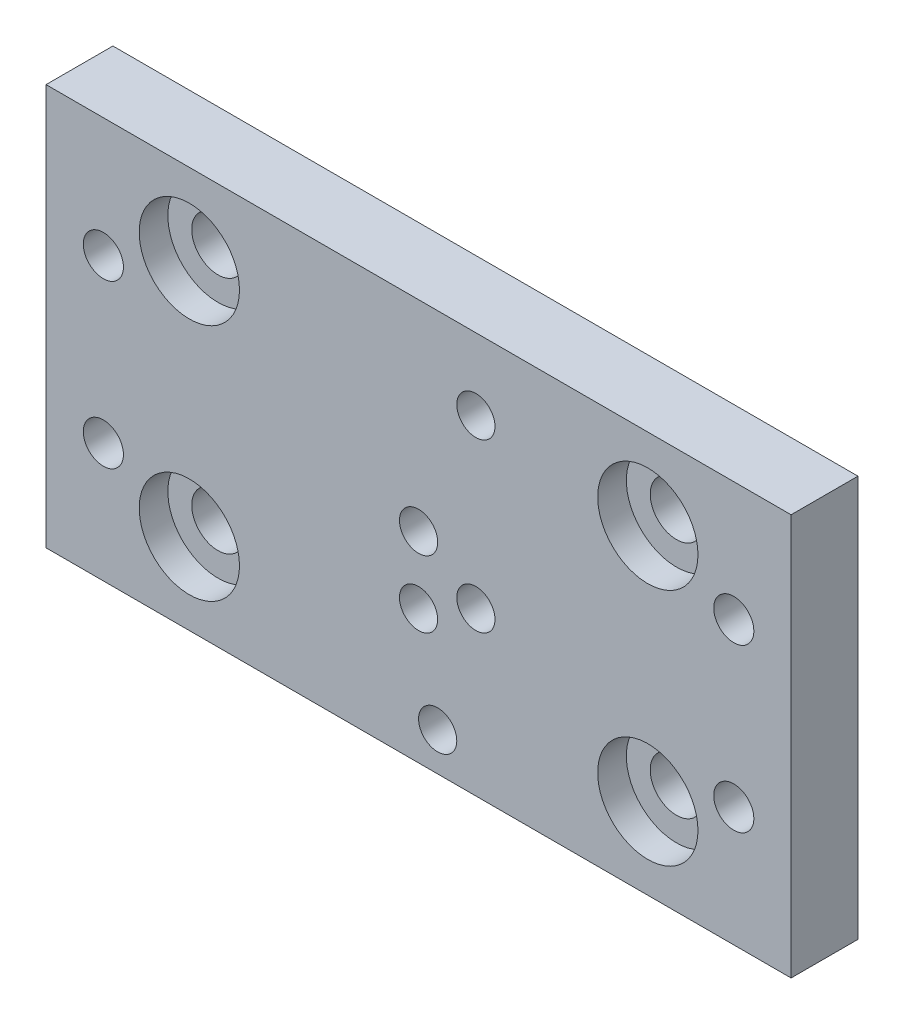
ISO-10303-21;
HEADER;
FILE_DESCRIPTION(('STEP AP214'),'2;1');
FILE_NAME('part.step','',(''),(''),'','','');
FILE_SCHEMA(('AUTOMOTIVE_DESIGN { 1 0 10303 214 1 1 1 1 }'));
ENDSEC;
DATA;
#1=APPLICATION_CONTEXT('core data for automotive mechanical design processes');
#2=APPLICATION_PROTOCOL_DEFINITION('international standard','automotive_design',2000,#1);
#3=PRODUCT_CONTEXT('',#1,'mechanical');
#4=PRODUCT('Part','Part','',(#3));
#5=PRODUCT_RELATED_PRODUCT_CATEGORY('part','',(#4));
#6=PRODUCT_DEFINITION_FORMATION('','',#4);
#7=PRODUCT_DEFINITION_CONTEXT('part definition',#1,'design');
#8=PRODUCT_DEFINITION('design','',#6,#7);
#9=PRODUCT_DEFINITION_SHAPE('','',#8);
#10=(LENGTH_UNIT() NAMED_UNIT(*) SI_UNIT(.MILLI.,.METRE.));
#11=(NAMED_UNIT(*) PLANE_ANGLE_UNIT() SI_UNIT($,.RADIAN.));
#12=(NAMED_UNIT(*) SI_UNIT($,.STERADIAN.) SOLID_ANGLE_UNIT());
#13=UNCERTAINTY_MEASURE_WITH_UNIT(LENGTH_MEASURE(1.E-05),#10,'distance_accuracy_value','');
#14=(GEOMETRIC_REPRESENTATION_CONTEXT(3) GLOBAL_UNCERTAINTY_ASSIGNED_CONTEXT((#13)) GLOBAL_UNIT_ASSIGNED_CONTEXT((#10,
#11,#12)) REPRESENTATION_CONTEXT('',''));
#15=CARTESIAN_POINT('',(0.,0.,0.));
#16=DIRECTION('',(0.,0.,1.));
#17=DIRECTION('',(1.,0.,0.));
#18=AXIS2_PLACEMENT_3D('',#15,#16,#17);
#19=CARTESIAN_POINT('',(2.,-17.,0.));
#20=DIRECTION('',(0.,0.,1.));
#21=DIRECTION('',(1.,0.,0.));
#22=AXIS2_PLACEMENT_3D('',#19,#20,#21);
#23=CYLINDRICAL_SURFACE('',#22,1.1);
#24=CARTESIAN_POINT('',(2.,-17.,0.));
#25=DIRECTION('',(0.,0.,1.));
#26=DIRECTION('',(1.,0.,0.));
#27=AXIS2_PLACEMENT_3D('',#24,#25,#26);
#28=CIRCLE('',#27,1.1);
#29=CARTESIAN_POINT('',(3.1,-17.,0.));
#30=VERTEX_POINT('',#29);
#31=EDGE_CURVE('E137',#30,#30,#28,.T.);
#32=ORIENTED_EDGE('',*,*,#31,.F.);
#33=EDGE_LOOP('',(#32));
#34=FACE_BOUND('',#33,.T.);
#35=CARTESIAN_POINT('',(2.,-17.,4.));
#36=DIRECTION('',(0.,0.,1.));
#37=DIRECTION('',(1.,0.,0.));
#38=AXIS2_PLACEMENT_3D('',#35,#36,#37);
#39=CIRCLE('',#38,1.1);
#40=CARTESIAN_POINT('',(3.1,-17.,4.));
#41=VERTEX_POINT('',#40);
#42=EDGE_CURVE('E38',#41,#41,#39,.F.);
#43=ORIENTED_EDGE('',*,*,#42,.F.);
#44=EDGE_LOOP('',(#43));
#45=FACE_BOUND('',#44,.T.);
#46=ADVANCED_FACE('F34',(#34,#45),#23,.F.);
#47=CARTESIAN_POINT('',(0.,-7.,0.));
#48=DIRECTION('',(0.,0.,1.));
#49=DIRECTION('',(1.,0.,0.));
#50=AXIS2_PLACEMENT_3D('',#47,#48,#49);
#51=CYLINDRICAL_SURFACE('',#50,1.1);
#52=CARTESIAN_POINT('',(0.,-7.,0.));
#53=DIRECTION('',(0.,0.,1.));
#54=DIRECTION('',(1.,0.,0.));
#55=AXIS2_PLACEMENT_3D('',#52,#53,#54);
#56=CIRCLE('',#55,1.1);
#57=CARTESIAN_POINT('',(1.1,-7.,0.));
#58=VERTEX_POINT('',#57);
#59=EDGE_CURVE('E180',#58,#58,#56,.T.);
#60=ORIENTED_EDGE('',*,*,#59,.F.);
#61=EDGE_LOOP('',(#60));
#62=FACE_BOUND('',#61,.T.);
#63=CARTESIAN_POINT('',(0.,-7.,4.));
#64=DIRECTION('',(0.,0.,1.));
#65=DIRECTION('',(1.,0.,0.));
#66=AXIS2_PLACEMENT_3D('',#63,#64,#65);
#67=CIRCLE('',#66,1.1);
#68=CARTESIAN_POINT('',(1.1,-7.,4.));
#69=VERTEX_POINT('',#68);
#70=EDGE_CURVE('E148',#69,#69,#67,.F.);
#71=ORIENTED_EDGE('',*,*,#70,.F.);
#72=EDGE_LOOP('',(#71));
#73=FACE_BOUND('',#72,.T.);
#74=ADVANCED_FACE('F254',(#62,#73),#51,.F.);
#75=CARTESIAN_POINT('',(6.,-4.,0.));
#76=DIRECTION('',(0.,0.,1.));
#77=DIRECTION('',(1.,0.,0.));
#78=AXIS2_PLACEMENT_3D('',#75,#76,#77);
#79=CYLINDRICAL_SURFACE('',#78,1.1);
#80=CARTESIAN_POINT('',(6.,-4.,0.));
#81=DIRECTION('',(0.,0.,1.));
#82=DIRECTION('',(1.,0.,0.));
#83=AXIS2_PLACEMENT_3D('',#80,#81,#82);
#84=CIRCLE('',#83,1.1);
#85=CARTESIAN_POINT('',(7.1,-4.,0.));
#86=VERTEX_POINT('',#85);
#87=EDGE_CURVE('E177',#86,#86,#84,.T.);
#88=ORIENTED_EDGE('',*,*,#87,.F.);
#89=EDGE_LOOP('',(#88));
#90=FACE_BOUND('',#89,.T.);
#91=CARTESIAN_POINT('',(6.,-4.,4.));
#92=DIRECTION('',(0.,0.,1.));
#93=DIRECTION('',(1.,0.,0.));
#94=AXIS2_PLACEMENT_3D('',#91,#92,#93);
#95=CIRCLE('',#94,1.1);
#96=CARTESIAN_POINT('',(7.1,-4.,4.));
#97=VERTEX_POINT('',#96);
#98=EDGE_CURVE('E144',#97,#97,#95,.F.);
#99=ORIENTED_EDGE('',*,*,#98,.F.);
#100=EDGE_LOOP('',(#99));
#101=FACE_BOUND('',#100,.T.);
#102=ADVANCED_FACE('F260',(#90,#101),#79,.F.);
#103=CARTESIAN_POINT('',(0.,0.,0.));
#104=DIRECTION('',(0.,0.,1.));
#105=DIRECTION('',(1.,0.,0.));
#106=AXIS2_PLACEMENT_3D('',#103,#104,#105);
#107=CYLINDRICAL_SURFACE('',#106,1.1);
#108=CARTESIAN_POINT('',(0.,0.,0.));
#109=DIRECTION('',(0.,0.,1.));
#110=DIRECTION('',(1.,0.,0.));
#111=AXIS2_PLACEMENT_3D('',#108,#109,#110);
#112=CIRCLE('',#111,1.1);
#113=CARTESIAN_POINT('',(1.1,0.,0.));
#114=VERTEX_POINT('',#113);
#115=EDGE_CURVE('E186',#114,#114,#112,.T.);
#116=ORIENTED_EDGE('',*,*,#115,.F.);
#117=EDGE_LOOP('',(#116));
#118=FACE_BOUND('',#117,.T.);
#119=CARTESIAN_POINT('',(0.,0.,4.));
#120=DIRECTION('',(0.,0.,1.));
#121=DIRECTION('',(1.,0.,0.));
#122=AXIS2_PLACEMENT_3D('',#119,#120,#121);
#123=CIRCLE('',#122,1.1);
#124=CARTESIAN_POINT('',(1.1,0.,4.));
#125=VERTEX_POINT('',#124);
#126=EDGE_CURVE('E139',#125,#125,#123,.F.);
#127=ORIENTED_EDGE('',*,*,#126,.F.);
#128=EDGE_LOOP('',(#127));
#129=FACE_BOUND('',#128,.T.);
#130=ADVANCED_FACE('F270',(#118,#129),#107,.F.);
#131=CARTESIAN_POINT('',(6.,13.5,0.));
#132=DIRECTION('',(0.,0.,1.));
#133=DIRECTION('',(1.,0.,0.));
#134=AXIS2_PLACEMENT_3D('',#131,#132,#133);
#135=CYLINDRICAL_SURFACE('',#134,1.1);
#136=CARTESIAN_POINT('',(6.,13.5,0.));
#137=DIRECTION('',(0.,0.,1.));
#138=DIRECTION('',(1.,0.,0.));
#139=AXIS2_PLACEMENT_3D('',#136,#137,#138);
#140=CIRCLE('',#139,1.1);
#141=CARTESIAN_POINT('',(7.1,13.5,0.));
#142=VERTEX_POINT('',#141);
#143=EDGE_CURVE('E183',#142,#142,#140,.T.);
#144=ORIENTED_EDGE('',*,*,#143,.F.);
#145=EDGE_LOOP('',(#144));
#146=FACE_BOUND('',#145,.T.);
#147=CARTESIAN_POINT('',(6.,13.5,4.));
#148=DIRECTION('',(0.,0.,1.));
#149=DIRECTION('',(1.,0.,0.));
#150=AXIS2_PLACEMENT_3D('',#147,#148,#149);
#151=CIRCLE('',#150,1.1);
#152=CARTESIAN_POINT('',(7.1,13.5,4.));
#153=VERTEX_POINT('',#152);
#154=EDGE_CURVE('E134',#153,#153,#151,.F.);
#155=ORIENTED_EDGE('',*,*,#154,.F.);
#156=EDGE_LOOP('',(#155));
#157=FACE_BOUND('',#156,.T.);
#158=ADVANCED_FACE('F273',(#146,#157),#135,.F.);
#159=CARTESIAN_POINT('',(-39.,21.,7.));
#160=DIRECTION('',(1.,0.,0.));
#161=DIRECTION('',(0.,0.,-1.));
#162=AXIS2_PLACEMENT_3D('',#159,#160,#161);
#163=PLANE('',#162);
#164=DIRECTION('',(0.,-1.,0.));
#165=VECTOR('',#164,1.);
#166=CARTESIAN_POINT('',(-39.,21.,0.));
#167=LINE('',#166,#165);
#168=CARTESIAN_POINT('',(-39.,21.,0.));
#169=VERTEX_POINT('',#168);
#170=CARTESIAN_POINT('',(-39.,-21.,0.));
#171=VERTEX_POINT('',#170);
#172=EDGE_CURVE('E81',#169,#171,#167,.T.);
#173=ORIENTED_EDGE('',*,*,#172,.T.);
#174=DIRECTION('',(0.,0.,-1.));
#175=VECTOR('',#174,1.);
#176=CARTESIAN_POINT('',(-39.,-21.,7.));
#177=LINE('',#176,#175);
#178=CARTESIAN_POINT('',(-39.,-21.,7.));
#179=VERTEX_POINT('',#178);
#180=EDGE_CURVE('E11',#179,#171,#177,.T.);
#181=ORIENTED_EDGE('',*,*,#180,.F.);
#182=DIRECTION('',(0.,-1.,0.));
#183=VECTOR('',#182,1.);
#184=CARTESIAN_POINT('',(-39.,21.,7.));
#185=LINE('',#184,#183);
#186=CARTESIAN_POINT('',(-39.,21.,7.));
#187=VERTEX_POINT('',#186);
#188=EDGE_CURVE('E104',#187,#179,#185,.T.);
#189=ORIENTED_EDGE('',*,*,#188,.F.);
#190=DIRECTION('',(0.,0.,-1.));
#191=VECTOR('',#190,1.);
#192=CARTESIAN_POINT('',(-39.,21.,7.));
#193=LINE('',#192,#191);
#194=EDGE_CURVE('E93',#187,#169,#193,.T.);
#195=ORIENTED_EDGE('',*,*,#194,.T.);
#196=EDGE_LOOP('',(#173,#181,#189,#195));
#197=FACE_BOUND('',#196,.T.);
#198=ADVANCED_FACE('F36',(#197),#163,.F.);
#199=CARTESIAN_POINT('',(-39.,-21.,7.));
#200=DIRECTION('',(0.,1.,0.));
#201=DIRECTION('',(-1.,0.,0.));
#202=AXIS2_PLACEMENT_3D('',#199,#200,#201);
#203=PLANE('',#202);
#204=DIRECTION('',(1.,0.,0.));
#205=VECTOR('',#204,1.);
#206=CARTESIAN_POINT('',(-39.,-21.,0.));
#207=LINE('',#206,#205);
#208=CARTESIAN_POINT('',(39.,-21.,0.));
#209=VERTEX_POINT('',#208);
#210=EDGE_CURVE('E77',#171,#209,#207,.T.);
#211=ORIENTED_EDGE('',*,*,#210,.T.);
#212=DIRECTION('',(0.,0.,-1.));
#213=VECTOR('',#212,1.);
#214=CARTESIAN_POINT('',(39.,-21.,7.));
#215=LINE('',#214,#213);
#216=CARTESIAN_POINT('',(39.,-21.,7.));
#217=VERTEX_POINT('',#216);
#218=EDGE_CURVE('E43',#217,#209,#215,.T.);
#219=ORIENTED_EDGE('',*,*,#218,.F.);
#220=DIRECTION('',(1.,0.,0.));
#221=VECTOR('',#220,1.);
#222=CARTESIAN_POINT('',(-39.,-21.,7.));
#223=LINE('',#222,#221);
#224=EDGE_CURVE('E89',#179,#217,#223,.T.);
#225=ORIENTED_EDGE('',*,*,#224,.F.);
#226=ORIENTED_EDGE('',*,*,#180,.T.);
#227=EDGE_LOOP('',(#211,#219,#225,#226));
#228=FACE_BOUND('',#227,.T.);
#229=ADVANCED_FACE('F88',(#228),#203,.F.);
#230=CARTESIAN_POINT('',(39.,21.,7.));
#231=DIRECTION('',(-1.,0.,0.));
#232=DIRECTION('',(0.,-1.,0.));
#233=AXIS2_PLACEMENT_3D('',#230,#231,#232);
#234=PLANE('',#233);
#235=DIRECTION('',(0.,1.,0.));
#236=VECTOR('',#235,1.);
#237=CARTESIAN_POINT('',(39.,21.,0.));
#238=LINE('',#237,#236);
#239=CARTESIAN_POINT('',(39.,21.,0.));
#240=VERTEX_POINT('',#239);
#241=EDGE_CURVE('E82',#209,#240,#238,.T.);
#242=ORIENTED_EDGE('',*,*,#241,.T.);
#243=DIRECTION('',(0.,0.,-1.));
#244=VECTOR('',#243,1.);
#245=CARTESIAN_POINT('',(39.,21.,7.));
#246=LINE('',#245,#244);
#247=CARTESIAN_POINT('',(39.,21.,7.));
#248=VERTEX_POINT('',#247);
#249=EDGE_CURVE('E110',#248,#240,#246,.T.);
#250=ORIENTED_EDGE('',*,*,#249,.F.);
#251=DIRECTION('',(0.,1.,0.));
#252=VECTOR('',#251,1.);
#253=CARTESIAN_POINT('',(39.,21.,7.));
#254=LINE('',#253,#252);
#255=EDGE_CURVE('E56',#217,#248,#254,.T.);
#256=ORIENTED_EDGE('',*,*,#255,.F.);
#257=ORIENTED_EDGE('',*,*,#218,.T.);
#258=EDGE_LOOP('',(#242,#250,#256,#257));
#259=FACE_BOUND('',#258,.T.);
#260=ADVANCED_FACE('F245',(#259),#234,.F.);
#261=CARTESIAN_POINT('',(-39.,21.,7.));
#262=DIRECTION('',(0.,-1.,0.));
#263=DIRECTION('',(1.,0.,0.));
#264=AXIS2_PLACEMENT_3D('',#261,#262,#263);
#265=PLANE('',#264);
#266=DIRECTION('',(-1.,0.,0.));
#267=VECTOR('',#266,1.);
#268=CARTESIAN_POINT('',(-39.,21.,0.));
#269=LINE('',#268,#267);
#270=EDGE_CURVE('E102',#240,#169,#269,.T.);
#271=ORIENTED_EDGE('',*,*,#270,.T.);
#272=ORIENTED_EDGE('',*,*,#194,.F.);
#273=DIRECTION('',(-1.,0.,0.));
#274=VECTOR('',#273,1.);
#275=CARTESIAN_POINT('',(-39.,21.,7.));
#276=LINE('',#275,#274);
#277=EDGE_CURVE('E51',#248,#187,#276,.T.);
#278=ORIENTED_EDGE('',*,*,#277,.F.);
#279=ORIENTED_EDGE('',*,*,#249,.T.);
#280=EDGE_LOOP('',(#271,#272,#278,#279));
#281=FACE_BOUND('',#280,.T.);
#282=ADVANCED_FACE('F241',(#281),#265,.F.);
#283=CARTESIAN_POINT('',(-39.,21.,7.));
#284=DIRECTION('',(0.,0.,1.));
#285=DIRECTION('',(1.,0.,0.));
#286=AXIS2_PLACEMENT_3D('',#283,#284,#285);
#287=PLANE('',#286);
#288=CARTESIAN_POINT('',(2.,-17.,7.));
#289=DIRECTION('',(0.,0.,1.));
#290=DIRECTION('',(1.,0.,0.));
#291=AXIS2_PLACEMENT_3D('',#288,#289,#290);
#292=CIRCLE('',#291,2.);
#293=CARTESIAN_POINT('',(4.,-17.,7.));
#294=VERTEX_POINT('',#293);
#295=EDGE_CURVE('E509',#294,#294,#292,.T.);
#296=ORIENTED_EDGE('',*,*,#295,.F.);
#297=EDGE_LOOP('',(#296));
#298=FACE_BOUND('',#297,.T.);
#299=CARTESIAN_POINT('',(0.,-7.,7.));
#300=DIRECTION('',(0.,0.,1.));
#301=DIRECTION('',(1.,0.,0.));
#302=AXIS2_PLACEMENT_3D('',#299,#300,#301);
#303=CIRCLE('',#302,2.);
#304=CARTESIAN_POINT('',(2.,-7.,7.));
#305=VERTEX_POINT('',#304);
#306=EDGE_CURVE('E157',#305,#305,#303,.T.);
#307=ORIENTED_EDGE('',*,*,#306,.F.);
#308=EDGE_LOOP('',(#307));
#309=FACE_BOUND('',#308,.T.);
#310=CARTESIAN_POINT('',(6.,-4.,7.));
#311=DIRECTION('',(0.,0.,1.));
#312=DIRECTION('',(1.,0.,0.));
#313=AXIS2_PLACEMENT_3D('',#310,#311,#312);
#314=CIRCLE('',#313,2.);
#315=CARTESIAN_POINT('',(8.,-4.,7.));
#316=VERTEX_POINT('',#315);
#317=EDGE_CURVE('E150',#316,#316,#314,.T.);
#318=ORIENTED_EDGE('',*,*,#317,.F.);
#319=EDGE_LOOP('',(#318));
#320=FACE_BOUND('',#319,.T.);
#321=CARTESIAN_POINT('',(0.,0.,7.));
#322=DIRECTION('',(0.,0.,1.));
#323=DIRECTION('',(1.,0.,0.));
#324=AXIS2_PLACEMENT_3D('',#321,#322,#323);
#325=CIRCLE('',#324,2.);
#326=CARTESIAN_POINT('',(2.,0.,7.));
#327=VERTEX_POINT('',#326);
#328=EDGE_CURVE('E146',#327,#327,#325,.T.);
#329=ORIENTED_EDGE('',*,*,#328,.F.);
#330=EDGE_LOOP('',(#329));
#331=FACE_BOUND('',#330,.T.);
#332=CARTESIAN_POINT('',(6.,13.5,7.));
#333=DIRECTION('',(0.,0.,1.));
#334=DIRECTION('',(1.,0.,0.));
#335=AXIS2_PLACEMENT_3D('',#332,#333,#334);
#336=CIRCLE('',#335,2.);
#337=CARTESIAN_POINT('',(8.,13.5,7.));
#338=VERTEX_POINT('',#337);
#339=EDGE_CURVE('E142',#338,#338,#336,.T.);
#340=ORIENTED_EDGE('',*,*,#339,.F.);
#341=EDGE_LOOP('',(#340));
#342=FACE_BOUND('',#341,.T.);
#343=CARTESIAN_POINT('',(-24.,12.5,7.));
#344=DIRECTION('',(0.,0.,1.));
#345=DIRECTION('',(1.,0.,0.));
#346=AXIS2_PLACEMENT_3D('',#343,#344,#345);
#347=CIRCLE('',#346,5.25);
#348=CARTESIAN_POINT('',(-18.75,12.5,7.));
#349=VERTEX_POINT('',#348);
#350=EDGE_CURVE('E133',#349,#349,#347,.T.);
#351=ORIENTED_EDGE('',*,*,#350,.F.);
#352=EDGE_LOOP('',(#351));
#353=FACE_BOUND('',#352,.T.);
#354=CARTESIAN_POINT('',(24.,12.5,7.));
#355=DIRECTION('',(0.,0.,1.));
#356=DIRECTION('',(1.,0.,0.));
#357=AXIS2_PLACEMENT_3D('',#354,#355,#356);
#358=CIRCLE('',#357,5.25);
#359=CARTESIAN_POINT('',(29.25,12.5,7.));
#360=VERTEX_POINT('',#359);
#361=EDGE_CURVE('E128',#360,#360,#358,.T.);
#362=ORIENTED_EDGE('',*,*,#361,.F.);
#363=EDGE_LOOP('',(#362));
#364=FACE_BOUND('',#363,.T.);
#365=CARTESIAN_POINT('',(24.,-12.5,7.));
#366=DIRECTION('',(0.,0.,1.));
#367=DIRECTION('',(1.,0.,0.));
#368=AXIS2_PLACEMENT_3D('',#365,#366,#367);
#369=CIRCLE('',#368,5.25);
#370=CARTESIAN_POINT('',(29.25,-12.5,7.));
#371=VERTEX_POINT('',#370);
#372=EDGE_CURVE('E123',#371,#371,#369,.T.);
#373=ORIENTED_EDGE('',*,*,#372,.F.);
#374=EDGE_LOOP('',(#373));
#375=FACE_BOUND('',#374,.T.);
#376=CARTESIAN_POINT('',(-24.,-12.5,7.));
#377=DIRECTION('',(0.,0.,1.));
#378=DIRECTION('',(1.,0.,0.));
#379=AXIS2_PLACEMENT_3D('',#376,#377,#378);
#380=CIRCLE('',#379,5.25);
#381=CARTESIAN_POINT('',(-18.75,-12.5,7.));
#382=VERTEX_POINT('',#381);
#383=EDGE_CURVE('E118',#382,#382,#380,.T.);
#384=ORIENTED_EDGE('',*,*,#383,.F.);
#385=EDGE_LOOP('',(#384));
#386=FACE_BOUND('',#385,.T.);
#387=CARTESIAN_POINT('',(33.,-8.5,7.));
#388=DIRECTION('',(0.,0.,1.));
#389=DIRECTION('',(1.,0.,0.));
#390=AXIS2_PLACEMENT_3D('',#387,#388,#389);
#391=CIRCLE('',#390,2.09999999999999);
#392=CARTESIAN_POINT('',(35.1,-8.5,7.));
#393=VERTEX_POINT('',#392);
#394=EDGE_CURVE('E117',#393,#393,#391,.T.);
#395=ORIENTED_EDGE('',*,*,#394,.F.);
#396=EDGE_LOOP('',(#395));
#397=FACE_BOUND('',#396,.T.);
#398=CARTESIAN_POINT('',(-33.,-8.5,7.));
#399=DIRECTION('',(0.,0.,1.));
#400=DIRECTION('',(1.,0.,0.));
#401=AXIS2_PLACEMENT_3D('',#398,#399,#400);
#402=CIRCLE('',#401,2.09999999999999);
#403=CARTESIAN_POINT('',(-30.9,-8.5,7.));
#404=VERTEX_POINT('',#403);
#405=EDGE_CURVE('E223',#404,#404,#402,.T.);
#406=ORIENTED_EDGE('',*,*,#405,.F.);
#407=EDGE_LOOP('',(#406));
#408=FACE_BOUND('',#407,.T.);
#409=CARTESIAN_POINT('',(-33.,8.5,7.));
#410=DIRECTION('',(0.,0.,1.));
#411=DIRECTION('',(1.,0.,0.));
#412=AXIS2_PLACEMENT_3D('',#409,#410,#411);
#413=CIRCLE('',#412,2.09999999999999);
#414=CARTESIAN_POINT('',(-30.9,8.5,7.));
#415=VERTEX_POINT('',#414);
#416=EDGE_CURVE('E229',#415,#415,#413,.T.);
#417=ORIENTED_EDGE('',*,*,#416,.F.);
#418=EDGE_LOOP('',(#417));
#419=FACE_BOUND('',#418,.T.);
#420=CARTESIAN_POINT('',(33.,8.5,7.));
#421=DIRECTION('',(0.,0.,1.));
#422=DIRECTION('',(1.,0.,0.));
#423=AXIS2_PLACEMENT_3D('',#420,#421,#422);
#424=CIRCLE('',#423,2.09999999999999);
#425=CARTESIAN_POINT('',(35.1,8.5,7.));
#426=VERTEX_POINT('',#425);
#427=EDGE_CURVE('E97',#426,#426,#424,.T.);
#428=ORIENTED_EDGE('',*,*,#427,.F.);
#429=EDGE_LOOP('',(#428));
#430=FACE_BOUND('',#429,.T.);
#431=ORIENTED_EDGE('',*,*,#188,.T.);
#432=ORIENTED_EDGE('',*,*,#224,.T.);
#433=ORIENTED_EDGE('',*,*,#255,.T.);
#434=ORIENTED_EDGE('',*,*,#277,.T.);
#435=EDGE_LOOP('',(#431,#432,#433,#434));
#436=FACE_BOUND('',#435,.T.);
#437=ADVANCED_FACE('F239',(#298,#309,#320,#331,#342,#353,#364,#375,#386,#397,#408,#419,#430,
#436),#287,.T.);
#438=CARTESIAN_POINT('',(-39.,21.,0.));
#439=DIRECTION('',(0.,0.,1.));
#440=DIRECTION('',(1.,0.,0.));
#441=AXIS2_PLACEMENT_3D('',#438,#439,#440);
#442=PLANE('',#441);
#443=ORIENTED_EDGE('',*,*,#31,.T.);
#444=EDGE_LOOP('',(#443));
#445=FACE_BOUND('',#444,.T.);
#446=ORIENTED_EDGE('',*,*,#87,.T.);
#447=EDGE_LOOP('',(#446));
#448=FACE_BOUND('',#447,.T.);
#449=ORIENTED_EDGE('',*,*,#59,.T.);
#450=EDGE_LOOP('',(#449));
#451=FACE_BOUND('',#450,.T.);
#452=ORIENTED_EDGE('',*,*,#143,.T.);
#453=EDGE_LOOP('',(#452));
#454=FACE_BOUND('',#453,.T.);
#455=ORIENTED_EDGE('',*,*,#115,.T.);
#456=EDGE_LOOP('',(#455));
#457=FACE_BOUND('',#456,.T.);
#458=CARTESIAN_POINT('',(-24.,12.5,0.));
#459=DIRECTION('',(0.,0.,1.));
#460=DIRECTION('',(1.,0.,0.));
#461=AXIS2_PLACEMENT_3D('',#458,#459,#460);
#462=CIRCLE('',#461,2.75);
#463=CARTESIAN_POINT('',(-21.25,12.5,0.));
#464=VERTEX_POINT('',#463);
#465=EDGE_CURVE('E129',#464,#464,#462,.T.);
#466=ORIENTED_EDGE('',*,*,#465,.T.);
#467=EDGE_LOOP('',(#466));
#468=FACE_BOUND('',#467,.T.);
#469=CARTESIAN_POINT('',(24.,12.5,0.));
#470=DIRECTION('',(0.,0.,1.));
#471=DIRECTION('',(1.,0.,0.));
#472=AXIS2_PLACEMENT_3D('',#469,#470,#471);
#473=CIRCLE('',#472,2.75);
#474=CARTESIAN_POINT('',(26.75,12.5,0.));
#475=VERTEX_POINT('',#474);
#476=EDGE_CURVE('E124',#475,#475,#473,.T.);
#477=ORIENTED_EDGE('',*,*,#476,.T.);
#478=EDGE_LOOP('',(#477));
#479=FACE_BOUND('',#478,.T.);
#480=CARTESIAN_POINT('',(24.,-12.5,0.));
#481=DIRECTION('',(0.,0.,1.));
#482=DIRECTION('',(1.,0.,0.));
#483=AXIS2_PLACEMENT_3D('',#480,#481,#482);
#484=CIRCLE('',#483,2.75);
#485=CARTESIAN_POINT('',(26.75,-12.5,0.));
#486=VERTEX_POINT('',#485);
#487=EDGE_CURVE('E119',#486,#486,#484,.T.);
#488=ORIENTED_EDGE('',*,*,#487,.T.);
#489=EDGE_LOOP('',(#488));
#490=FACE_BOUND('',#489,.T.);
#491=CARTESIAN_POINT('',(-24.,-12.5,0.));
#492=DIRECTION('',(0.,0.,1.));
#493=DIRECTION('',(1.,0.,0.));
#494=AXIS2_PLACEMENT_3D('',#491,#492,#493);
#495=CIRCLE('',#494,2.75);
#496=CARTESIAN_POINT('',(-21.25,-12.5,0.));
#497=VERTEX_POINT('',#496);
#498=EDGE_CURVE('E114',#497,#497,#495,.T.);
#499=ORIENTED_EDGE('',*,*,#498,.T.);
#500=EDGE_LOOP('',(#499));
#501=FACE_BOUND('',#500,.T.);
#502=CARTESIAN_POINT('',(33.,-8.5,0.));
#503=DIRECTION('',(0.,0.,1.));
#504=DIRECTION('',(1.,0.,0.));
#505=AXIS2_PLACEMENT_3D('',#502,#503,#504);
#506=CIRCLE('',#505,2.1);
#507=CARTESIAN_POINT('',(35.1,-8.5,0.));
#508=VERTEX_POINT('',#507);
#509=EDGE_CURVE('E220',#508,#508,#506,.T.);
#510=ORIENTED_EDGE('',*,*,#509,.T.);
#511=EDGE_LOOP('',(#510));
#512=FACE_BOUND('',#511,.T.);
#513=CARTESIAN_POINT('',(-33.,-8.5,0.));
#514=DIRECTION('',(0.,0.,1.));
#515=DIRECTION('',(1.,0.,0.));
#516=AXIS2_PLACEMENT_3D('',#513,#514,#515);
#517=CIRCLE('',#516,2.1);
#518=CARTESIAN_POINT('',(-30.9,-8.5,0.));
#519=VERTEX_POINT('',#518);
#520=EDGE_CURVE('E226',#519,#519,#517,.T.);
#521=ORIENTED_EDGE('',*,*,#520,.T.);
#522=EDGE_LOOP('',(#521));
#523=FACE_BOUND('',#522,.T.);
#524=CARTESIAN_POINT('',(-33.,8.5,0.));
#525=DIRECTION('',(0.,0.,1.));
#526=DIRECTION('',(1.,0.,0.));
#527=AXIS2_PLACEMENT_3D('',#524,#525,#526);
#528=CIRCLE('',#527,2.1);
#529=CARTESIAN_POINT('',(-30.9,8.5,0.));
#530=VERTEX_POINT('',#529);
#531=EDGE_CURVE('E232',#530,#530,#528,.T.);
#532=ORIENTED_EDGE('',*,*,#531,.T.);
#533=EDGE_LOOP('',(#532));
#534=FACE_BOUND('',#533,.T.);
#535=CARTESIAN_POINT('',(33.,8.5,0.));
#536=DIRECTION('',(0.,0.,1.));
#537=DIRECTION('',(1.,0.,0.));
#538=AXIS2_PLACEMENT_3D('',#535,#536,#537);
#539=CIRCLE('',#538,2.1);
#540=CARTESIAN_POINT('',(35.1,8.5,0.));
#541=VERTEX_POINT('',#540);
#542=EDGE_CURVE('E94',#541,#541,#539,.T.);
#543=ORIENTED_EDGE('',*,*,#542,.T.);
#544=EDGE_LOOP('',(#543));
#545=FACE_BOUND('',#544,.T.);
#546=ORIENTED_EDGE('',*,*,#172,.F.);
#547=ORIENTED_EDGE('',*,*,#270,.F.);
#548=ORIENTED_EDGE('',*,*,#241,.F.);
#549=ORIENTED_EDGE('',*,*,#210,.F.);
#550=EDGE_LOOP('',(#546,#547,#548,#549));
#551=FACE_BOUND('',#550,.T.);
#552=ADVANCED_FACE('F78',(#445,#448,#451,#454,#457,#468,#479,#490,#501,#512,#523,#534,#545,
#551),#442,.F.);
#553=CARTESIAN_POINT('',(33.,8.5,7.));
#554=DIRECTION('',(0.,0.,1.));
#555=DIRECTION('',(1.,0.,0.));
#556=AXIS2_PLACEMENT_3D('',#553,#554,#555);
#557=CYLINDRICAL_SURFACE('',#556,2.09999999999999);
#558=ORIENTED_EDGE('',*,*,#542,.F.);
#559=EDGE_LOOP('',(#558));
#560=FACE_BOUND('',#559,.T.);
#561=ORIENTED_EDGE('',*,*,#427,.T.);
#562=EDGE_LOOP('',(#561));
#563=FACE_BOUND('',#562,.T.);
#564=ADVANCED_FACE('F237',(#560,#563),#557,.F.);
#565=CARTESIAN_POINT('',(-33.,8.5,7.));
#566=DIRECTION('',(0.,0.,1.));
#567=DIRECTION('',(1.,0.,0.));
#568=AXIS2_PLACEMENT_3D('',#565,#566,#567);
#569=CYLINDRICAL_SURFACE('',#568,2.09999999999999);
#570=ORIENTED_EDGE('',*,*,#531,.F.);
#571=EDGE_LOOP('',(#570));
#572=FACE_BOUND('',#571,.T.);
#573=ORIENTED_EDGE('',*,*,#416,.T.);
#574=EDGE_LOOP('',(#573));
#575=FACE_BOUND('',#574,.T.);
#576=ADVANCED_FACE('F336',(#572,#575),#569,.F.);
#577=CARTESIAN_POINT('',(-33.,-8.5,7.));
#578=DIRECTION('',(0.,0.,1.));
#579=DIRECTION('',(1.,0.,0.));
#580=AXIS2_PLACEMENT_3D('',#577,#578,#579);
#581=CYLINDRICAL_SURFACE('',#580,2.09999999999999);
#582=ORIENTED_EDGE('',*,*,#520,.F.);
#583=EDGE_LOOP('',(#582));
#584=FACE_BOUND('',#583,.T.);
#585=ORIENTED_EDGE('',*,*,#405,.T.);
#586=EDGE_LOOP('',(#585));
#587=FACE_BOUND('',#586,.T.);
#588=ADVANCED_FACE('F332',(#584,#587),#581,.F.);
#589=CARTESIAN_POINT('',(33.,-8.5,7.));
#590=DIRECTION('',(0.,0.,1.));
#591=DIRECTION('',(1.,0.,0.));
#592=AXIS2_PLACEMENT_3D('',#589,#590,#591);
#593=CYLINDRICAL_SURFACE('',#592,2.09999999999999);
#594=ORIENTED_EDGE('',*,*,#509,.F.);
#595=EDGE_LOOP('',(#594));
#596=FACE_BOUND('',#595,.T.);
#597=ORIENTED_EDGE('',*,*,#394,.T.);
#598=EDGE_LOOP('',(#597));
#599=FACE_BOUND('',#598,.T.);
#600=ADVANCED_FACE('F322',(#596,#599),#593,.F.);
#601=CARTESIAN_POINT('',(-24.,-12.5,7.));
#602=DIRECTION('',(0.,0.,1.));
#603=DIRECTION('',(1.,0.,0.));
#604=AXIS2_PLACEMENT_3D('',#601,#602,#603);
#605=CYLINDRICAL_SURFACE('',#604,2.75);
#606=CARTESIAN_POINT('',(-24.,-12.5,4.));
#607=DIRECTION('',(0.,0.,1.));
#608=DIRECTION('',(1.,0.,0.));
#609=AXIS2_PLACEMENT_3D('',#606,#607,#608);
#610=CIRCLE('',#609,2.75);
#611=CARTESIAN_POINT('',(-21.25,-12.5,4.));
#612=VERTEX_POINT('',#611);
#613=EDGE_CURVE('E122',#612,#612,#610,.T.);
#614=ORIENTED_EDGE('',*,*,#613,.T.);
#615=EDGE_LOOP('',(#614));
#616=FACE_BOUND('',#615,.T.);
#617=ORIENTED_EDGE('',*,*,#498,.F.);
#618=EDGE_LOOP('',(#617));
#619=FACE_BOUND('',#618,.T.);
#620=ADVANCED_FACE('F318',(#616,#619),#605,.F.);
#621=CARTESIAN_POINT('',(-24.,-12.5,7.));
#622=DIRECTION('',(0.,0.,1.));
#623=DIRECTION('',(1.,0.,0.));
#624=AXIS2_PLACEMENT_3D('',#621,#622,#623);
#625=CYLINDRICAL_SURFACE('',#624,5.25);
#626=CARTESIAN_POINT('',(-24.,-12.5,4.));
#627=DIRECTION('',(0.,0.,1.));
#628=DIRECTION('',(1.,0.,0.));
#629=AXIS2_PLACEMENT_3D('',#626,#627,#628);
#630=CIRCLE('',#629,5.25);
#631=CARTESIAN_POINT('',(-18.75,-12.5,4.));
#632=VERTEX_POINT('',#631);
#633=EDGE_CURVE('E213',#632,#632,#630,.T.);
#634=ORIENTED_EDGE('',*,*,#633,.F.);
#635=EDGE_LOOP('',(#634));
#636=FACE_BOUND('',#635,.T.);
#637=ORIENTED_EDGE('',*,*,#383,.T.);
#638=EDGE_LOOP('',(#637));
#639=FACE_BOUND('',#638,.T.);
#640=ADVANCED_FACE('F321',(#636,#639),#625,.F.);
#641=CARTESIAN_POINT('',(-21.25,-12.5,4.));
#642=DIRECTION('',(0.,0.,-1.));
#643=DIRECTION('',(-1.,0.,0.));
#644=AXIS2_PLACEMENT_3D('',#641,#642,#643);
#645=PLANE('',#644);
#646=ORIENTED_EDGE('',*,*,#613,.F.);
#647=EDGE_LOOP('',(#646));
#648=FACE_BOUND('',#647,.T.);
#649=ORIENTED_EDGE('',*,*,#633,.T.);
#650=EDGE_LOOP('',(#649));
#651=FACE_BOUND('',#650,.T.);
#652=ADVANCED_FACE('F310',(#648,#651),#645,.F.);
#653=CARTESIAN_POINT('',(24.,-12.5,7.));
#654=DIRECTION('',(0.,0.,1.));
#655=DIRECTION('',(1.,0.,0.));
#656=AXIS2_PLACEMENT_3D('',#653,#654,#655);
#657=CYLINDRICAL_SURFACE('',#656,2.75);
#658=CARTESIAN_POINT('',(24.,-12.5,4.));
#659=DIRECTION('',(0.,0.,1.));
#660=DIRECTION('',(1.,0.,0.));
#661=AXIS2_PLACEMENT_3D('',#658,#659,#660);
#662=CIRCLE('',#661,2.75);
#663=CARTESIAN_POINT('',(26.75,-12.5,4.));
#664=VERTEX_POINT('',#663);
#665=EDGE_CURVE('E127',#664,#664,#662,.T.);
#666=ORIENTED_EDGE('',*,*,#665,.T.);
#667=EDGE_LOOP('',(#666));
#668=FACE_BOUND('',#667,.T.);
#669=ORIENTED_EDGE('',*,*,#487,.F.);
#670=EDGE_LOOP('',(#669));
#671=FACE_BOUND('',#670,.T.);
#672=ADVANCED_FACE('F306',(#668,#671),#657,.F.);
#673=CARTESIAN_POINT('',(24.,-12.5,7.));
#674=DIRECTION('',(0.,0.,1.));
#675=DIRECTION('',(1.,0.,0.));
#676=AXIS2_PLACEMENT_3D('',#673,#674,#675);
#677=CYLINDRICAL_SURFACE('',#676,5.25);
#678=CARTESIAN_POINT('',(24.,-12.5,4.));
#679=DIRECTION('',(0.,0.,1.));
#680=DIRECTION('',(1.,0.,0.));
#681=AXIS2_PLACEMENT_3D('',#678,#679,#680);
#682=CIRCLE('',#681,5.25);
#683=CARTESIAN_POINT('',(29.25,-12.5,4.));
#684=VERTEX_POINT('',#683);
#685=EDGE_CURVE('E206',#684,#684,#682,.T.);
#686=ORIENTED_EDGE('',*,*,#685,.F.);
#687=EDGE_LOOP('',(#686));
#688=FACE_BOUND('',#687,.T.);
#689=ORIENTED_EDGE('',*,*,#372,.T.);
#690=EDGE_LOOP('',(#689));
#691=FACE_BOUND('',#690,.T.);
#692=ADVANCED_FACE('F309',(#688,#691),#677,.F.);
#693=CARTESIAN_POINT('',(26.75,-12.5,4.));
#694=DIRECTION('',(0.,0.,-1.));
#695=DIRECTION('',(-1.,0.,0.));
#696=AXIS2_PLACEMENT_3D('',#693,#694,#695);
#697=PLANE('',#696);
#698=ORIENTED_EDGE('',*,*,#665,.F.);
#699=EDGE_LOOP('',(#698));
#700=FACE_BOUND('',#699,.T.);
#701=ORIENTED_EDGE('',*,*,#685,.T.);
#702=EDGE_LOOP('',(#701));
#703=FACE_BOUND('',#702,.T.);
#704=ADVANCED_FACE('F298',(#700,#703),#697,.F.);
#705=CARTESIAN_POINT('',(24.,12.5,7.));
#706=DIRECTION('',(0.,0.,1.));
#707=DIRECTION('',(1.,0.,0.));
#708=AXIS2_PLACEMENT_3D('',#705,#706,#707);
#709=CYLINDRICAL_SURFACE('',#708,2.75);
#710=CARTESIAN_POINT('',(24.,12.5,4.));
#711=DIRECTION('',(0.,0.,1.));
#712=DIRECTION('',(1.,0.,0.));
#713=AXIS2_PLACEMENT_3D('',#710,#711,#712);
#714=CIRCLE('',#713,2.75);
#715=CARTESIAN_POINT('',(26.75,12.5,4.));
#716=VERTEX_POINT('',#715);
#717=EDGE_CURVE('E132',#716,#716,#714,.T.);
#718=ORIENTED_EDGE('',*,*,#717,.T.);
#719=EDGE_LOOP('',(#718));
#720=FACE_BOUND('',#719,.T.);
#721=ORIENTED_EDGE('',*,*,#476,.F.);
#722=EDGE_LOOP('',(#721));
#723=FACE_BOUND('',#722,.T.);
#724=ADVANCED_FACE('F294',(#720,#723),#709,.F.);
#725=CARTESIAN_POINT('',(24.,12.5,7.));
#726=DIRECTION('',(0.,0.,1.));
#727=DIRECTION('',(1.,0.,0.));
#728=AXIS2_PLACEMENT_3D('',#725,#726,#727);
#729=CYLINDRICAL_SURFACE('',#728,5.25);
#730=CARTESIAN_POINT('',(24.,12.5,4.));
#731=DIRECTION('',(0.,0.,1.));
#732=DIRECTION('',(1.,0.,0.));
#733=AXIS2_PLACEMENT_3D('',#730,#731,#732);
#734=CIRCLE('',#733,5.25);
#735=CARTESIAN_POINT('',(29.25,12.5,4.));
#736=VERTEX_POINT('',#735);
#737=EDGE_CURVE('E199',#736,#736,#734,.T.);
#738=ORIENTED_EDGE('',*,*,#737,.F.);
#739=EDGE_LOOP('',(#738));
#740=FACE_BOUND('',#739,.T.);
#741=ORIENTED_EDGE('',*,*,#361,.T.);
#742=EDGE_LOOP('',(#741));
#743=FACE_BOUND('',#742,.T.);
#744=ADVANCED_FACE('F297',(#740,#743),#729,.F.);
#745=CARTESIAN_POINT('',(26.75,12.5,4.));
#746=DIRECTION('',(0.,0.,-1.));
#747=DIRECTION('',(-1.,0.,0.));
#748=AXIS2_PLACEMENT_3D('',#745,#746,#747);
#749=PLANE('',#748);
#750=ORIENTED_EDGE('',*,*,#717,.F.);
#751=EDGE_LOOP('',(#750));
#752=FACE_BOUND('',#751,.T.);
#753=ORIENTED_EDGE('',*,*,#737,.T.);
#754=EDGE_LOOP('',(#753));
#755=FACE_BOUND('',#754,.T.);
#756=ADVANCED_FACE('F284',(#752,#755),#749,.F.);
#757=CARTESIAN_POINT('',(-24.,12.5,7.));
#758=DIRECTION('',(0.,0.,1.));
#759=DIRECTION('',(1.,0.,0.));
#760=AXIS2_PLACEMENT_3D('',#757,#758,#759);
#761=CYLINDRICAL_SURFACE('',#760,2.75);
#762=CARTESIAN_POINT('',(-24.,12.5,4.));
#763=DIRECTION('',(0.,0.,1.));
#764=DIRECTION('',(1.,0.,0.));
#765=AXIS2_PLACEMENT_3D('',#762,#763,#764);
#766=CIRCLE('',#765,2.75);
#767=CARTESIAN_POINT('',(-21.25,12.5,4.));
#768=VERTEX_POINT('',#767);
#769=EDGE_CURVE('E189',#768,#768,#766,.T.);
#770=ORIENTED_EDGE('',*,*,#769,.T.);
#771=EDGE_LOOP('',(#770));
#772=FACE_BOUND('',#771,.T.);
#773=ORIENTED_EDGE('',*,*,#465,.F.);
#774=EDGE_LOOP('',(#773));
#775=FACE_BOUND('',#774,.T.);
#776=ADVANCED_FACE('F280',(#772,#775),#761,.F.);
#777=CARTESIAN_POINT('',(-24.,12.5,7.));
#778=DIRECTION('',(0.,0.,1.));
#779=DIRECTION('',(1.,0.,0.));
#780=AXIS2_PLACEMENT_3D('',#777,#778,#779);
#781=CYLINDRICAL_SURFACE('',#780,5.25);
#782=CARTESIAN_POINT('',(-24.,12.5,4.));
#783=DIRECTION('',(0.,0.,1.));
#784=DIRECTION('',(1.,0.,0.));
#785=AXIS2_PLACEMENT_3D('',#782,#783,#784);
#786=CIRCLE('',#785,5.25);
#787=CARTESIAN_POINT('',(-18.75,12.5,4.));
#788=VERTEX_POINT('',#787);
#789=EDGE_CURVE('E192',#788,#788,#786,.T.);
#790=ORIENTED_EDGE('',*,*,#789,.F.);
#791=EDGE_LOOP('',(#790));
#792=FACE_BOUND('',#791,.T.);
#793=ORIENTED_EDGE('',*,*,#350,.T.);
#794=EDGE_LOOP('',(#793));
#795=FACE_BOUND('',#794,.T.);
#796=ADVANCED_FACE('F283',(#792,#795),#781,.F.);
#797=CARTESIAN_POINT('',(-21.25,12.5,4.));
#798=DIRECTION('',(0.,0.,-1.));
#799=DIRECTION('',(-1.,0.,0.));
#800=AXIS2_PLACEMENT_3D('',#797,#798,#799);
#801=PLANE('',#800);
#802=ORIENTED_EDGE('',*,*,#769,.F.);
#803=EDGE_LOOP('',(#802));
#804=FACE_BOUND('',#803,.T.);
#805=ORIENTED_EDGE('',*,*,#789,.T.);
#806=EDGE_LOOP('',(#805));
#807=FACE_BOUND('',#806,.T.);
#808=ADVANCED_FACE('F286',(#804,#807),#801,.F.);
#809=CARTESIAN_POINT('',(6.,13.5,4.));
#810=DIRECTION('',(0.,0.,1.));
#811=DIRECTION('',(1.,0.,0.));
#812=AXIS2_PLACEMENT_3D('',#809,#810,#811);
#813=PLANE('',#812);
#814=CARTESIAN_POINT('',(6.,13.5,4.));
#815=DIRECTION('',(0.,0.,1.));
#816=DIRECTION('',(1.,0.,0.));
#817=AXIS2_PLACEMENT_3D('',#814,#815,#816);
#818=CIRCLE('',#817,2.);
#819=CARTESIAN_POINT('',(8.,13.5,4.));
#820=VERTEX_POINT('',#819);
#821=EDGE_CURVE('E138',#820,#820,#818,.T.);
#822=ORIENTED_EDGE('',*,*,#821,.T.);
#823=EDGE_LOOP('',(#822));
#824=FACE_BOUND('',#823,.T.);
#825=ORIENTED_EDGE('',*,*,#154,.T.);
#826=EDGE_LOOP('',(#825));
#827=FACE_BOUND('',#826,.T.);
#828=ADVANCED_FACE('F289',(#824,#827),#813,.T.);
#829=CARTESIAN_POINT('',(6.,13.5,4.));
#830=DIRECTION('',(0.,0.,1.));
#831=DIRECTION('',(1.,0.,0.));
#832=AXIS2_PLACEMENT_3D('',#829,#830,#831);
#833=CYLINDRICAL_SURFACE('',#832,2.);
#834=ORIENTED_EDGE('',*,*,#821,.F.);
#835=EDGE_LOOP('',(#834));
#836=FACE_BOUND('',#835,.T.);
#837=ORIENTED_EDGE('',*,*,#339,.T.);
#838=EDGE_LOOP('',(#837));
#839=FACE_BOUND('',#838,.T.);
#840=ADVANCED_FACE('F267',(#836,#839),#833,.F.);
#841=CARTESIAN_POINT('',(0.,0.,4.));
#842=DIRECTION('',(0.,0.,1.));
#843=DIRECTION('',(1.,0.,0.));
#844=AXIS2_PLACEMENT_3D('',#841,#842,#843);
#845=PLANE('',#844);
#846=CARTESIAN_POINT('',(0.,0.,4.));
#847=DIRECTION('',(0.,0.,1.));
#848=DIRECTION('',(1.,0.,0.));
#849=AXIS2_PLACEMENT_3D('',#846,#847,#848);
#850=CIRCLE('',#849,2.);
#851=CARTESIAN_POINT('',(2.,0.,4.));
#852=VERTEX_POINT('',#851);
#853=EDGE_CURVE('E143',#852,#852,#850,.T.);
#854=ORIENTED_EDGE('',*,*,#853,.T.);
#855=EDGE_LOOP('',(#854));
#856=FACE_BOUND('',#855,.T.);
#857=ORIENTED_EDGE('',*,*,#126,.T.);
#858=EDGE_LOOP('',(#857));
#859=FACE_BOUND('',#858,.T.);
#860=ADVANCED_FACE('F388',(#856,#859),#845,.T.);
#861=CARTESIAN_POINT('',(0.,0.,4.));
#862=DIRECTION('',(0.,0.,1.));
#863=DIRECTION('',(1.,0.,0.));
#864=AXIS2_PLACEMENT_3D('',#861,#862,#863);
#865=CYLINDRICAL_SURFACE('',#864,2.);
#866=ORIENTED_EDGE('',*,*,#853,.F.);
#867=EDGE_LOOP('',(#866));
#868=FACE_BOUND('',#867,.T.);
#869=ORIENTED_EDGE('',*,*,#328,.T.);
#870=EDGE_LOOP('',(#869));
#871=FACE_BOUND('',#870,.T.);
#872=ADVANCED_FACE('F390',(#868,#871),#865,.F.);
#873=CARTESIAN_POINT('',(6.,-4.,4.));
#874=DIRECTION('',(0.,0.,1.));
#875=DIRECTION('',(1.,0.,0.));
#876=AXIS2_PLACEMENT_3D('',#873,#874,#875);
#877=PLANE('',#876);
#878=CARTESIAN_POINT('',(6.,-4.,4.));
#879=DIRECTION('',(0.,0.,1.));
#880=DIRECTION('',(1.,0.,0.));
#881=AXIS2_PLACEMENT_3D('',#878,#879,#880);
#882=CIRCLE('',#881,2.);
#883=CARTESIAN_POINT('',(8.,-4.,4.));
#884=VERTEX_POINT('',#883);
#885=EDGE_CURVE('E147',#884,#884,#882,.T.);
#886=ORIENTED_EDGE('',*,*,#885,.T.);
#887=EDGE_LOOP('',(#886));
#888=FACE_BOUND('',#887,.T.);
#889=ORIENTED_EDGE('',*,*,#98,.T.);
#890=EDGE_LOOP('',(#889));
#891=FACE_BOUND('',#890,.T.);
#892=ADVANCED_FACE('F397',(#888,#891),#877,.T.);
#893=CARTESIAN_POINT('',(6.,-4.,4.));
#894=DIRECTION('',(0.,0.,1.));
#895=DIRECTION('',(1.,0.,0.));
#896=AXIS2_PLACEMENT_3D('',#893,#894,#895);
#897=CYLINDRICAL_SURFACE('',#896,2.);
#898=ORIENTED_EDGE('',*,*,#885,.F.);
#899=EDGE_LOOP('',(#898));
#900=FACE_BOUND('',#899,.T.);
#901=ORIENTED_EDGE('',*,*,#317,.T.);
#902=EDGE_LOOP('',(#901));
#903=FACE_BOUND('',#902,.T.);
#904=ADVANCED_FACE('F402',(#900,#903),#897,.F.);
#905=CARTESIAN_POINT('',(0.,-7.,4.));
#906=DIRECTION('',(0.,0.,1.));
#907=DIRECTION('',(1.,0.,0.));
#908=AXIS2_PLACEMENT_3D('',#905,#906,#907);
#909=PLANE('',#908);
#910=CARTESIAN_POINT('',(0.,-7.,4.));
#911=DIRECTION('',(0.,0.,1.));
#912=DIRECTION('',(1.,0.,0.));
#913=AXIS2_PLACEMENT_3D('',#910,#911,#912);
#914=CIRCLE('',#913,2.);
#915=CARTESIAN_POINT('',(2.,-7.,4.));
#916=VERTEX_POINT('',#915);
#917=EDGE_CURVE('E151',#916,#916,#914,.T.);
#918=ORIENTED_EDGE('',*,*,#917,.T.);
#919=EDGE_LOOP('',(#918));
#920=FACE_BOUND('',#919,.T.);
#921=ORIENTED_EDGE('',*,*,#70,.T.);
#922=EDGE_LOOP('',(#921));
#923=FACE_BOUND('',#922,.T.);
#924=ADVANCED_FACE('F461',(#920,#923),#909,.T.);
#925=CARTESIAN_POINT('',(0.,-7.,4.));
#926=DIRECTION('',(0.,0.,1.));
#927=DIRECTION('',(1.,0.,0.));
#928=AXIS2_PLACEMENT_3D('',#925,#926,#927);
#929=CYLINDRICAL_SURFACE('',#928,2.);
#930=ORIENTED_EDGE('',*,*,#917,.F.);
#931=EDGE_LOOP('',(#930));
#932=FACE_BOUND('',#931,.T.);
#933=ORIENTED_EDGE('',*,*,#306,.T.);
#934=EDGE_LOOP('',(#933));
#935=FACE_BOUND('',#934,.T.);
#936=ADVANCED_FACE('F470',(#932,#935),#929,.F.);
#937=CARTESIAN_POINT('',(2.,-17.,4.));
#938=DIRECTION('',(0.,0.,1.));
#939=DIRECTION('',(1.,0.,0.));
#940=AXIS2_PLACEMENT_3D('',#937,#938,#939);
#941=PLANE('',#940);
#942=CARTESIAN_POINT('',(2.,-17.,4.));
#943=DIRECTION('',(0.,0.,1.));
#944=DIRECTION('',(1.,0.,0.));
#945=AXIS2_PLACEMENT_3D('',#942,#943,#944);
#946=CIRCLE('',#945,2.);
#947=CARTESIAN_POINT('',(4.,-17.,4.));
#948=VERTEX_POINT('',#947);
#949=EDGE_CURVE('E506',#948,#948,#946,.T.);
#950=ORIENTED_EDGE('',*,*,#949,.T.);
#951=EDGE_LOOP('',(#950));
#952=FACE_BOUND('',#951,.T.);
#953=ORIENTED_EDGE('',*,*,#42,.T.);
#954=EDGE_LOOP('',(#953));
#955=FACE_BOUND('',#954,.T.);
#956=ADVANCED_FACE('F479',(#952,#955),#941,.T.);
#957=CARTESIAN_POINT('',(2.,-17.,4.));
#958=DIRECTION('',(0.,0.,1.));
#959=DIRECTION('',(1.,0.,0.));
#960=AXIS2_PLACEMENT_3D('',#957,#958,#959);
#961=CYLINDRICAL_SURFACE('',#960,2.);
#962=ORIENTED_EDGE('',*,*,#949,.F.);
#963=EDGE_LOOP('',(#962));
#964=FACE_BOUND('',#963,.T.);
#965=ORIENTED_EDGE('',*,*,#295,.T.);
#966=EDGE_LOOP('',(#965));
#967=FACE_BOUND('',#966,.T.);
#968=ADVANCED_FACE('F489',(#964,#967),#961,.F.);
#969=CLOSED_SHELL('',(#46,#74,#102,#130,#158,#198,#229,#260,#282,#437,#552,#564,#576,#588,#600,
#620,#640,#652,#672,#692,#704,#724,#744,#756,#776,#796,#808,#828,#840,#860,#872,#892,#904,#924,
#936,#956,#968));
#970=MANIFOLD_SOLID_BREP('B2',#969);
#971=ADVANCED_BREP_SHAPE_REPRESENTATION('',(#18,#970),#14);
#972=SHAPE_DEFINITION_REPRESENTATION(#9,#971);
ENDSEC;
END-ISO-10303-21;
